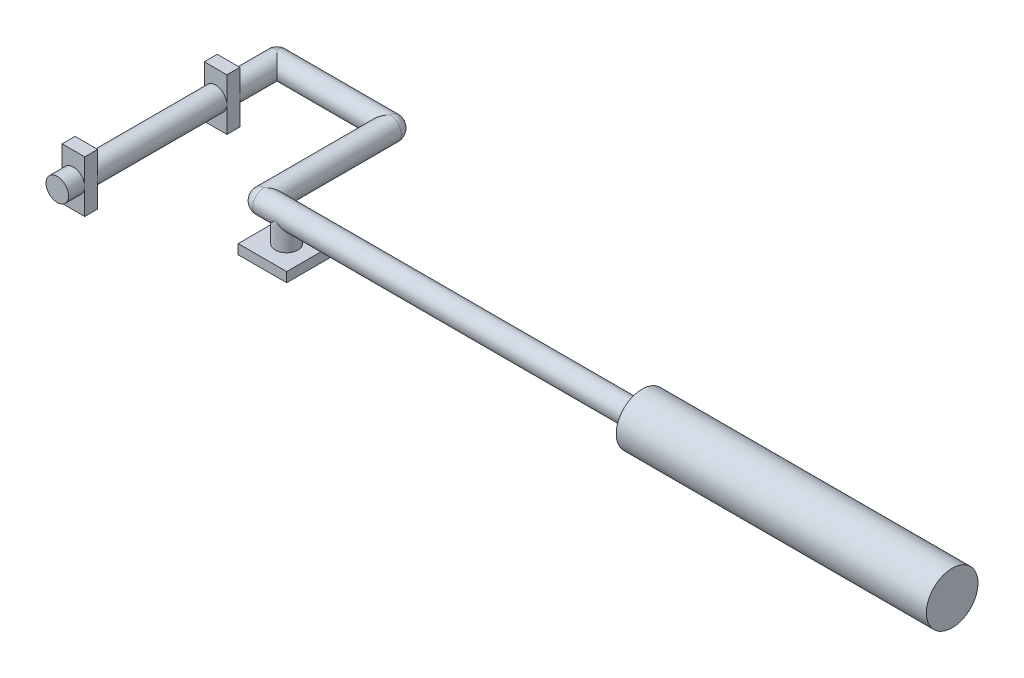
from build123d import *

# Parameters (mm, degrees)
EXTRUSION1_DEPTH      = 20
EXTRUSION1_DEPTH_BACK = 20
ESQUISSE1_R           = 3.5
ESQUISSE2_W           = 7
ESQUISSE2_H           = 16
EXTRUSION2_DEPTH      = 4
EXTRUSION3_DEPTH      = 5
EXTRUSION4_START      = 15
ESQUISSE4_R           = 3.5
EXTRUSION4_DEPTH      = 15
ESQUISSE5_R           = 3.5
EXTRUSION5_DEPTH      = 35
ESQUISSE6_W           = 3.5
ESQUISSE6_H           = 39
ESQUISSE7_W           = 150
ESQUISSE7_H           = 3.5
ESQUISSE11_R          = 3.5
EXTRUSION6_DEPTH      = 8
ESQUISSE12_W          = 15
ESQUISSE12_H          = 15
EXTRUSION7_DEPTH      = 3
EXTRUSION8_DEPTH      = 63
EXTRUSION8_DEPTH_BACK = 33
ESQUISSE13_R          = 7.99160358


with BuildPart() as part:
    # Esquisse1 → Extrusion1 (new, two sides: drawn at the far end of the back side and taken through both)
    with BuildSketch(Plane.XY.offset(-EXTRUSION1_DEPTH_BACK)):
        Circle(ESQUISSE1_R)
    extrude(amount=EXTRUSION1_DEPTH + EXTRUSION1_DEPTH_BACK)

    # Esquisse2 → Extrusion2 (add)
    with BuildSketch(Plane.XY.offset(20)):
        Rectangle(ESQUISSE2_W, ESQUISSE2_H)
    extrusion2 = extrude(amount=EXTRUSION2_DEPTH)

    # Esquisse3 → Extrusion3 (add)
    with BuildSketch(Plane.XY.offset(24)):
        with BuildLine():
            ThreePointArc((3.5, 0), (0, 3.5), (-3.5, 0))
            ThreePointArc((-3.5, 0), (0, -3.5), (3.5, 0))
        make_face()
    extrude(amount=EXTRUSION3_DEPTH)

    # Sym_trie1: Extrusion2 across plane
    add(extrusion2.mirror(Plane.XY))

    # Esquisse4 → Extrusion4 (add)
    with BuildSketch(Plane(origin=(0, 0, -24), x_dir=(-1, 0, 0), z_dir=(0, 0, -1)).offset(EXTRUSION4_START)):
        Circle(ESQUISSE4_R)
    extrude(amount=-EXTRUSION4_DEPTH)

    # Esquisse5 → Extrusion5 (add)
    with BuildSketch(Plane(origin=(0, 0, 0), x_dir=(0, 0, -1), z_dir=(1, 0, 0))):
        with Locations(Location((39, 0, 0), (0, 0, 180))):
            Circle(ESQUISSE5_R)
    extrude(amount=EXTRUSION5_DEPTH)

    # Esquisse6 → R_volution1 (revolve)
    with BuildSketch(Plane(origin=(0, 0, 0), x_dir=(1, 0, 0), z_dir=(0, 1, 0))):
        with Locations((33.25, 19.5)):
            Rectangle(ESQUISSE6_W, ESQUISSE6_H)
    revolve(axis=Axis((35, 0, -42.5), (0, 0, 1)))

    # Esquisse7 → R_volution2 (revolve)
    with BuildSketch(Plane(origin=(0, 0, 0), x_dir=(1, 0, 0), z_dir=(0, 1, 0)), mode=Mode.PRIVATE) as r_volution2_sk:
        with Locations((110, 1.75)):
            Rectangle(ESQUISSE7_W, ESQUISSE7_H)
    revolve(r_volution2_sk.sketch.rotate(Axis((23.572307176, 0, 0), (1, 0, 0)), 180), axis=Axis((23.572307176, 0, 0), (1, 0, 0)))

    # Esquisse8 → R_volution3 (revolve)
    with BuildSketch(Plane(origin=(0, 0, -39), x_dir=(-1, 0, 0), z_dir=(0, 0, -1))):
        with BuildLine():
            Line((0, 3.5), (0, -3.5))
            ThreePointArc((0, -3.5), (3.5, 0), (0, 3.5))
        make_face()
    revolve(axis=Axis((0, -11.220838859, -39), (0, 1, 0)))

    # Esquisse9 → R_volution4 (revolve)
    with BuildSketch(Plane(origin=(35, 0, 0), x_dir=(0, 0, -1), z_dir=(1, 0, 0))):
        with BuildLine():
            Line((39, 3.5), (39, -3.5))
            ThreePointArc((39, -3.5), (42.5, 0), (39, 3.5))
        make_face()
    revolve(axis=Axis((35, 8.692834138, -39), (0, -1, 0)))

    # Esquisse10 → R_volution5 (revolve)
    with BuildSketch(Plane.XY):
        with BuildLine():
            Line((35, -3.5), (35, 3.5))
            ThreePointArc((35, 3.5), (31.5, 0), (35, -3.5))
        make_face()
    revolve(axis=Axis((35, 7.683783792, 0), (0, -1, 0)))

    # Esquisse11 → Extrusion6 (add)
    with BuildSketch(Plane(origin=(0, 0, 0), x_dir=(1, 0, 0), z_dir=(0, 1, 0))):
        with Locations(Location((42, 0, 0), (0, 0, 270))):
            Circle(ESQUISSE11_R)
    extrude(amount=-EXTRUSION6_DEPTH)

    # Esquisse12 → Extrusion7 (add)
    with BuildSketch(Plane.XZ.offset(8)):
        with Locations((42, 0)):
            Rectangle(ESQUISSE12_W, ESQUISSE12_H)
    extrude(amount=EXTRUSION7_DEPTH)

    # Esquisse13 → Extrusion8 (add, two sides: drawn at the far end of the back side and taken through both)
    with BuildSketch(Plane(origin=(185, 0, 0), x_dir=(0, 0, -1), z_dir=(1, 0, 0)).offset(-EXTRUSION8_DEPTH_BACK)):
        Circle(ESQUISSE13_R)
    extrude(amount=EXTRUSION8_DEPTH + EXTRUSION8_DEPTH_BACK)


solid = part.part
